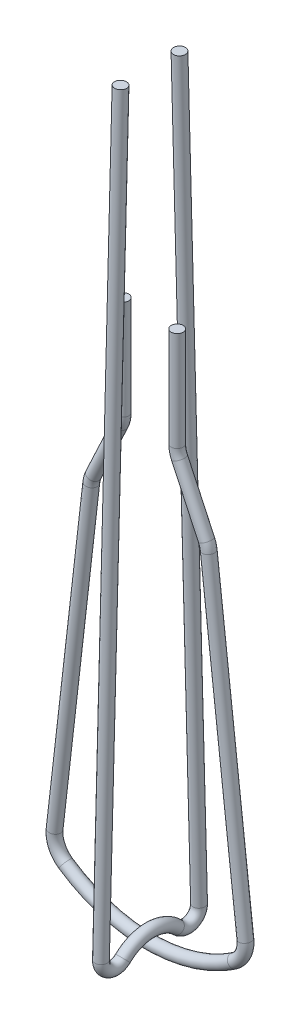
from build123d import *

# Parameters (mm, degrees)
SKETCH3_R = 1.4605
SKETCH6_R = 1.4605


with BuildPart() as part:
    # Sweep1: sweep along a path in Sketch1
    with BuildLine(Plane.XY) as sweep1_path:
        Line((-6.6675, 19.299592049), (-6.6675, -5.111096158))
        ThreePointArc((-6.6675, -5.111096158), (-6.818020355, -6.485487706), (-7.262445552, -7.79472212))
        Line((-7.262445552, -7.79472212), (-13.852116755, -21.926317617))
        ThreePointArc((-13.852116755, -21.926317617), (-14.207605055, -22.882585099), (-14.405365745, -23.883439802))
        Line((-14.405365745, -23.883439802), (-23.399543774, -101.980768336))
        ThreePointArc((-23.399543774, -101.980768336), (-22.86203339, -105.356884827), (-20.651915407, -107.965037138))
        ThreePointArc((-20.651915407, -107.965037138), (0, -114.3), (20.651915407, -107.965037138))
        ThreePointArc((20.651915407, -107.965037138), (22.86203339, -105.356884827), (23.399543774, -101.980768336))
        Line((23.399543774, -101.980768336), (14.405365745, -23.883439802))
        ThreePointArc((14.405365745, -23.883439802), (14.207605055, -22.882585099), (13.852116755, -21.926317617))
        Line((13.852116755, -21.926317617), (7.262445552, -7.79472212))
        ThreePointArc((7.262445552, -7.79472212), (6.818020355, -6.485487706), (6.6675, -5.111096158))
        Line((6.6675, -5.111096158), (6.6675, 19.299592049))
    # Sketch3 → Sweep1 (sweep)
    with BuildSketch(Plane(origin=(-6.6675, 19.299592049, 0), x_dir=(1, 0, 0), z_dir=(0, -1, 0))):
        Circle(SKETCH3_R)
    sweep(path=sweep1_path.line)

    # Sweep2: sweep along a path in Sketch5
    with BuildLine(Plane(origin=(0, 0, 0), x_dir=(0, 0, -1), z_dir=(1, 0, 0))) as sweep2_path:
        Line((7.229790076, 71.374), (12.03431374, -112.103356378))
        ThreePointArc((12.03431374, -112.103356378), (10.133025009, -115.095257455), (6.6453013, -114.461101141))
        ThreePointArc((6.6453013, -114.461101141), (0, -111.76), (-6.6453013, -114.461101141))
        ThreePointArc((-6.6453013, -114.461101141), (-10.133025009, -115.095257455), (-12.03431374, -112.103356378))
        Line((-12.03431374, -112.103356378), (-7.229790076, 71.374))
    # Sketch6 → Sweep2 (sweep)
    with BuildSketch(Plane(origin=(0, 71.374, 7.229790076), x_dir=(1, 0, 0), z_dir=(0, -0.9996573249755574, 0.026176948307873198))):
        Circle(SKETCH6_R)
    sweep(path=sweep2_path.line)


solid = part.part
